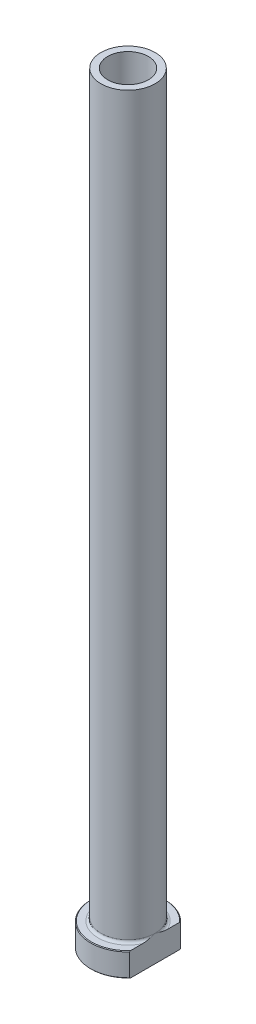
ISO-10303-21;
HEADER;
FILE_DESCRIPTION(('STEP AP214'),'2;1');
FILE_NAME('part.step','',(''),(''),'','','');
FILE_SCHEMA(('AUTOMOTIVE_DESIGN { 1 0 10303 214 1 1 1 1 }'));
ENDSEC;
DATA;
#1=APPLICATION_CONTEXT('core data for automotive mechanical design processes');
#2=APPLICATION_PROTOCOL_DEFINITION('international standard','automotive_design',2000,#1);
#3=PRODUCT_CONTEXT('',#1,'mechanical');
#4=PRODUCT('Part','Part','',(#3));
#5=PRODUCT_RELATED_PRODUCT_CATEGORY('part','',(#4));
#6=PRODUCT_DEFINITION_FORMATION('','',#4);
#7=PRODUCT_DEFINITION_CONTEXT('part definition',#1,'design');
#8=PRODUCT_DEFINITION('design','',#6,#7);
#9=PRODUCT_DEFINITION_SHAPE('','',#8);
#10=(LENGTH_UNIT() NAMED_UNIT(*) SI_UNIT(.MILLI.,.METRE.));
#11=(NAMED_UNIT(*) PLANE_ANGLE_UNIT() SI_UNIT($,.RADIAN.));
#12=(NAMED_UNIT(*) SI_UNIT($,.STERADIAN.) SOLID_ANGLE_UNIT());
#13=UNCERTAINTY_MEASURE_WITH_UNIT(LENGTH_MEASURE(1.E-05),#10,'distance_accuracy_value','');
#14=(GEOMETRIC_REPRESENTATION_CONTEXT(3) GLOBAL_UNCERTAINTY_ASSIGNED_CONTEXT((#13)) GLOBAL_UNIT_ASSIGNED_CONTEXT((#10,
#11,#12)) REPRESENTATION_CONTEXT('',''));
#15=CARTESIAN_POINT('',(0.,0.,0.));
#16=DIRECTION('',(0.,0.,1.));
#17=DIRECTION('',(1.,0.,0.));
#18=AXIS2_PLACEMENT_3D('',#15,#16,#17);
#19=CARTESIAN_POINT('',(0.,92.1876809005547,0.));
#20=DIRECTION('',(0.,1.,0.));
#21=DIRECTION('',(0.,0.,1.));
#22=AXIS2_PLACEMENT_3D('',#19,#20,#21);
#23=CYLINDRICAL_SURFACE('',#22,6.00000000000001);
#24=CARTESIAN_POINT('',(0.,225.,0.));
#25=DIRECTION('',(0.,1.,0.));
#26=DIRECTION('',(0.,0.,1.));
#27=AXIS2_PLACEMENT_3D('',#24,#25,#26);
#28=CIRCLE('',#27,6.00000000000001);
#29=CARTESIAN_POINT('',(0.,225.,6.00000000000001));
#30=VERTEX_POINT('',#29);
#31=EDGE_CURVE('E167',#30,#30,#28,.T.);
#32=ORIENTED_EDGE('',*,*,#31,.T.);
#33=EDGE_LOOP('',(#32));
#34=FACE_BOUND('',#33,.T.);
#35=CARTESIAN_POINT('',(0.,170.,0.));
#36=DIRECTION('',(0.,1.,0.));
#37=DIRECTION('',(0.,0.,1.));
#38=AXIS2_PLACEMENT_3D('',#35,#36,#37);
#39=CIRCLE('',#38,6.00000000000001);
#40=CARTESIAN_POINT('',(0.,170.,6.00000000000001));
#41=VERTEX_POINT('',#40);
#42=EDGE_CURVE('E170',#41,#41,#39,.T.);
#43=ORIENTED_EDGE('',*,*,#42,.F.);
#44=EDGE_LOOP('',(#43));
#45=FACE_BOUND('',#44,.T.);
#46=ADVANCED_FACE('F32',(#34,#45),#23,.F.);
#47=CARTESIAN_POINT('',(-6.00000000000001,225.,0.));
#48=DIRECTION('',(0.,1.,0.));
#49=DIRECTION('',(0.,0.,1.));
#50=AXIS2_PLACEMENT_3D('',#47,#48,#49);
#51=PLANE('',#50);
#52=CARTESIAN_POINT('',(0.,225.,0.));
#53=DIRECTION('',(0.,1.,0.));
#54=DIRECTION('',(0.,0.,1.));
#55=AXIS2_PLACEMENT_3D('',#52,#53,#54);
#56=CIRCLE('',#55,8.00000000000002);
#57=CARTESIAN_POINT('',(0.,225.,8.00000000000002));
#58=VERTEX_POINT('',#57);
#59=EDGE_CURVE('E174',#58,#58,#56,.T.);
#60=ORIENTED_EDGE('',*,*,#59,.T.);
#61=EDGE_LOOP('',(#60));
#62=FACE_BOUND('',#61,.T.);
#63=ORIENTED_EDGE('',*,*,#31,.F.);
#64=EDGE_LOOP('',(#63));
#65=FACE_BOUND('',#64,.T.);
#66=ADVANCED_FACE('F157',(#62,#65),#51,.T.);
#67=CARTESIAN_POINT('',(0.,92.1876809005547,0.));
#68=DIRECTION('',(0.,1.,0.));
#69=DIRECTION('',(0.,0.,1.));
#70=AXIS2_PLACEMENT_3D('',#67,#68,#69);
#71=CYLINDRICAL_SURFACE('',#70,8.);
#72=CARTESIAN_POINT('',(0.,7.8,0.));
#73=DIRECTION('',(0.,1.,0.));
#74=DIRECTION('',(0.,0.,1.));
#75=AXIS2_PLACEMENT_3D('',#72,#73,#74);
#76=CIRCLE('',#75,8.);
#77=CARTESIAN_POINT('',(8.,7.8,0.));
#78=VERTEX_POINT('',#77);
#79=EDGE_CURVE('E180',#78,#78,#76,.T.);
#80=ORIENTED_EDGE('',*,*,#79,.T.);
#81=EDGE_LOOP('',(#80));
#82=FACE_BOUND('',#81,.T.);
#83=ORIENTED_EDGE('',*,*,#59,.F.);
#84=EDGE_LOOP('',(#83));
#85=FACE_BOUND('',#84,.T.);
#86=ADVANCED_FACE('F162',(#82,#85),#71,.T.);
#87=CARTESIAN_POINT('',(-7.99999999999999,7.,0.));
#88=DIRECTION('',(0.,1.,0.));
#89=DIRECTION('',(0.,0.,1.));
#90=AXIS2_PLACEMENT_3D('',#87,#88,#89);
#91=PLANE('',#90);
#92=DIRECTION('',(0.,0.,1.));
#93=VECTOR('',#92,1.);
#94=CARTESIAN_POINT('',(8.,7.,0.));
#95=LINE('',#94,#93);
#96=CARTESIAN_POINT('',(8.,7.,-7.25534285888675));
#97=VERTEX_POINT('',#96);
#98=CARTESIAN_POINT('',(8.,7.,-3.66606055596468));
#99=VERTEX_POINT('',#98);
#100=EDGE_CURVE('E54',#97,#99,#95,.T.);
#101=ORIENTED_EDGE('',*,*,#100,.F.);
#102=CARTESIAN_POINT('',(0.,7.,0.));
#103=DIRECTION('',(0.,1.,0.));
#104=DIRECTION('',(0.,0.,1.));
#105=AXIS2_PLACEMENT_3D('',#102,#103,#104);
#106=CIRCLE('',#105,10.8);
#107=CARTESIAN_POINT('',(8.,7.,7.25534285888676));
#108=VERTEX_POINT('',#107);
#109=EDGE_CURVE('E186',#97,#108,#106,.T.);
#110=ORIENTED_EDGE('',*,*,#109,.T.);
#111=CARTESIAN_POINT('',(8.,7.,3.66606055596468));
#112=VERTEX_POINT('',#111);
#113=EDGE_CURVE('E134',#112,#108,#95,.T.);
#114=ORIENTED_EDGE('',*,*,#113,.F.);
#115=CARTESIAN_POINT('',(0.,7.,0.));
#116=DIRECTION('',(0.,1.,0.));
#117=DIRECTION('',(0.,0.,1.));
#118=AXIS2_PLACEMENT_3D('',#115,#116,#117);
#119=CIRCLE('',#118,8.8);
#120=EDGE_CURVE('E183',#112,#99,#119,.F.);
#121=ORIENTED_EDGE('',*,*,#120,.T.);
#122=EDGE_LOOP('',(#101,#110,#114,#121));
#123=FACE_BOUND('',#122,.T.);
#124=ADVANCED_FACE('F197',(#123),#91,.T.);
#125=CARTESIAN_POINT('',(0.,92.1876809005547,0.));
#126=DIRECTION('',(0.,1.,0.));
#127=DIRECTION('',(0.,0.,1.));
#128=AXIS2_PLACEMENT_3D('',#125,#126,#127);
#129=CYLINDRICAL_SURFACE('',#128,11.);
#130=DIRECTION('',(0.,-1.,0.));
#131=VECTOR('',#130,1.);
#132=CARTESIAN_POINT('',(8.,225.,7.54983443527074));
#133=LINE('',#132,#131);
#134=CARTESIAN_POINT('',(8.,6.79999999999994,7.54983443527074));
#135=VERTEX_POINT('',#134);
#136=CARTESIAN_POINT('',(8.,0.200000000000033,7.54983443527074));
#137=VERTEX_POINT('',#136);
#138=EDGE_CURVE('E82',#135,#137,#133,.T.);
#139=ORIENTED_EDGE('',*,*,#138,.F.);
#140=CARTESIAN_POINT('',(0.,6.79999999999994,0.));
#141=DIRECTION('',(0.,1.,0.));
#142=DIRECTION('',(0.,0.,1.));
#143=AXIS2_PLACEMENT_3D('',#140,#141,#142);
#144=CIRCLE('',#143,11.);
#145=CARTESIAN_POINT('',(8.,6.79999999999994,-7.54983443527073));
#146=VERTEX_POINT('',#145);
#147=EDGE_CURVE('E95',#135,#146,#144,.F.);
#148=ORIENTED_EDGE('',*,*,#147,.T.);
#149=DIRECTION('',(0.,-1.,0.));
#150=VECTOR('',#149,1.);
#151=CARTESIAN_POINT('',(8.,225.,-7.54983443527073));
#152=LINE('',#151,#150);
#153=CARTESIAN_POINT('',(8.,0.200000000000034,-7.54983443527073));
#154=VERTEX_POINT('',#153);
#155=EDGE_CURVE('E192',#146,#154,#152,.T.);
#156=ORIENTED_EDGE('',*,*,#155,.T.);
#157=CARTESIAN_POINT('',(0.,0.200000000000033,0.));
#158=DIRECTION('',(0.,-1.,0.));
#159=DIRECTION('',(0.,0.,-1.));
#160=AXIS2_PLACEMENT_3D('',#157,#158,#159);
#161=CIRCLE('',#160,11.);
#162=EDGE_CURVE('E98',#154,#137,#161,.F.);
#163=ORIENTED_EDGE('',*,*,#162,.T.);
#164=EDGE_LOOP('',(#139,#148,#156,#163));
#165=FACE_BOUND('',#164,.T.);
#166=ADVANCED_FACE('F190',(#165),#129,.T.);
#167=CARTESIAN_POINT('',(-11.,0.,0.));
#168=DIRECTION('',(0.,-1.,0.));
#169=DIRECTION('',(0.,0.,-1.));
#170=AXIS2_PLACEMENT_3D('',#167,#168,#169);
#171=PLANE('',#170);
#172=CARTESIAN_POINT('',(0.,0.,0.));
#173=DIRECTION('',(0.,-1.,0.));
#174=DIRECTION('',(0.,0.,-1.));
#175=AXIS2_PLACEMENT_3D('',#172,#173,#174);
#176=CIRCLE('',#175,6.75000000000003);
#177=CARTESIAN_POINT('',(0.,0.,-6.75000000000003));
#178=VERTEX_POINT('',#177);
#179=EDGE_CURVE('E40',#178,#178,#176,.F.);
#180=ORIENTED_EDGE('',*,*,#179,.T.);
#181=EDGE_LOOP('',(#180));
#182=FACE_BOUND('',#181,.T.);
#183=DIRECTION('',(0.,0.,-1.));
#184=VECTOR('',#183,1.);
#185=CARTESIAN_POINT('',(8.,0.,7.54983443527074));
#186=LINE('',#185,#184);
#187=CARTESIAN_POINT('',(8.,0.,7.25534285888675));
#188=VERTEX_POINT('',#187);
#189=CARTESIAN_POINT('',(8.,0.,-7.25534285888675));
#190=VERTEX_POINT('',#189);
#191=EDGE_CURVE('E47',#188,#190,#186,.T.);
#192=ORIENTED_EDGE('',*,*,#191,.F.);
#193=CARTESIAN_POINT('',(0.,0.,0.));
#194=DIRECTION('',(0.,-1.,0.));
#195=DIRECTION('',(0.,0.,-1.));
#196=AXIS2_PLACEMENT_3D('',#193,#194,#195);
#197=CIRCLE('',#196,10.7999999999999);
#198=EDGE_CURVE('E92',#188,#190,#197,.T.);
#199=ORIENTED_EDGE('',*,*,#198,.T.);
#200=EDGE_LOOP('',(#192,#199));
#201=FACE_BOUND('',#200,.T.);
#202=ADVANCED_FACE('F91',(#182,#201),#171,.T.);
#203=CARTESIAN_POINT('',(0.,92.1876809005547,0.));
#204=DIRECTION('',(0.,1.,0.));
#205=DIRECTION('',(0.,0.,1.));
#206=AXIS2_PLACEMENT_3D('',#203,#204,#205);
#207=CYLINDRICAL_SURFACE('',#206,6.25);
#208=CARTESIAN_POINT('',(0.,0.500000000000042,0.));
#209=DIRECTION('',(0.,-1.,0.));
#210=DIRECTION('',(0.,0.,-1.));
#211=AXIS2_PLACEMENT_3D('',#208,#209,#210);
#212=CIRCLE('',#211,6.25);
#213=CARTESIAN_POINT('',(0.,0.500000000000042,-6.25));
#214=VERTEX_POINT('',#213);
#215=EDGE_CURVE('E11',#214,#214,#212,.T.);
#216=ORIENTED_EDGE('',*,*,#215,.T.);
#217=EDGE_LOOP('',(#216));
#218=FACE_BOUND('',#217,.T.);
#219=CARTESIAN_POINT('',(0.,158.,0.));
#220=DIRECTION('',(0.,1.,0.));
#221=DIRECTION('',(0.,0.,1.));
#222=AXIS2_PLACEMENT_3D('',#219,#220,#221);
#223=CIRCLE('',#222,6.25000000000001);
#224=CARTESIAN_POINT('',(0.,158.,6.25000000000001));
#225=VERTEX_POINT('',#224);
#226=EDGE_CURVE('E172',#225,#225,#223,.T.);
#227=ORIENTED_EDGE('',*,*,#226,.T.);
#228=EDGE_LOOP('',(#227));
#229=FACE_BOUND('',#228,.T.);
#230=ADVANCED_FACE('F215',(#218,#229),#207,.F.);
#231=CARTESIAN_POINT('',(0.,158.,0.));
#232=DIRECTION('',(0.,-1.,0.));
#233=DIRECTION('',(0.,0.,-1.));
#234=AXIS2_PLACEMENT_3D('',#231,#232,#233);
#235=CONICAL_SURFACE('',#234,6.25000000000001,0.0208303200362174);
#236=ORIENTED_EDGE('',*,*,#42,.T.);
#237=EDGE_LOOP('',(#236));
#238=FACE_BOUND('',#237,.T.);
#239=ORIENTED_EDGE('',*,*,#226,.F.);
#240=EDGE_LOOP('',(#239));
#241=FACE_BOUND('',#240,.T.);
#242=ADVANCED_FACE('F111',(#238,#241),#235,.F.);
#243=CARTESIAN_POINT('',(0.,7.8,0.));
#244=DIRECTION('',(0.,1.,0.));
#245=DIRECTION('',(0.,0.,1.));
#246=AXIS2_PLACEMENT_3D('',#243,#244,#245);
#247=TOROIDAL_SURFACE('',#246,8.8,0.8);
#248=ORIENTED_EDGE('',*,*,#120,.F.);
#249=CARTESIAN_POINT('',(8.,7.8,0.));
#250=CARTESIAN_POINT('',(8.,7.80000101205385,-1.09663887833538E-10));
#251=CARTESIAN_POINT('',(8.,7.80000202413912,2.93324122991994E-07));
#252=CARTESIAN_POINT('',(8.,7.80000394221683,1.16283100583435E-06));
#253=CARTESIAN_POINT('',(8.,7.80000483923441,1.75365147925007E-06));
#254=CARTESIAN_POINT('',(8.,7.80000665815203,3.16446795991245E-06));
#255=CARTESIAN_POINT('',(8.,7.80000756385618,4.00549183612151E-06));
#256=CARTESIAN_POINT('',(8.,7.80000923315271,5.78347948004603E-06));
#257=CARTESIAN_POINT('',(8.,7.8000099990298,6.71842053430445E-06));
#258=CARTESIAN_POINT('',(8.,7.80001270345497,1.02037220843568E-05));
#259=CARTESIAN_POINT('',(8.,7.80001449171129,1.28740408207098E-05));
#260=CARTESIAN_POINT('',(8.,7.80001755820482,1.82727392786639E-05));
#261=CARTESIAN_POINT('',(8.,7.8000188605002,2.09881564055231E-05));
#262=CARTESIAN_POINT('',(8.,7.80002405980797,3.2064781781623E-05));
#263=CARTESIAN_POINT('',(8.,7.8000277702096,4.05225605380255E-05));
#264=CARTESIAN_POINT('',(8.,7.80003348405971,5.68037726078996E-05));
#265=CARTESIAN_POINT('',(8.,7.80003564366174,6.45728891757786E-05));
#266=CARTESIAN_POINT('',(8.,7.8000509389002,0.000121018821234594));
#267=CARTESIAN_POINT('',(8.,7.80006211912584,0.000170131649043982));
#268=CARTESIAN_POINT('',(8.,7.80011099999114,0.000362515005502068));
#269=CARTESIAN_POINT('',(8.,7.80015802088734,0.000503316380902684));
#270=CARTESIAN_POINT('',(8.,7.80033939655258,0.00105711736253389));
#271=CARTESIAN_POINT('',(8.,7.80046737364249,0.0014716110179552));
#272=CARTESIAN_POINT('',(8.,7.80097644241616,0.00310648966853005));
#273=CARTESIAN_POINT('',(8.,7.80136531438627,0.00432501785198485));
#274=CARTESIAN_POINT('',(8.,7.80297358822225,0.0093795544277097));
#275=CARTESIAN_POINT('',(8.,7.80418342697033,0.0132178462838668));
#276=CARTESIAN_POINT('',(7.99999999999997,7.82754122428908,0.0873020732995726));
#277=CARTESIAN_POINT('',(7.99999999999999,7.84979021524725,0.157524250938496));
#278=CARTESIAN_POINT('',(8.00000000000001,7.89322681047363,0.295235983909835));
#279=CARTESIAN_POINT('',(8.,7.91442151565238,0.362723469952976));
#280=CARTESIAN_POINT('',(8.,7.95923432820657,0.506178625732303));
#281=CARTESIAN_POINT('',(8.,7.98282525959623,0.58215493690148));
#282=CARTESIAN_POINT('',(8.,8.02983069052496,0.735069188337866));
#283=CARTESIAN_POINT('',(8.,8.05324046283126,0.812008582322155));
#284=CARTESIAN_POINT('',(8.,8.09303795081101,0.944645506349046));
#285=CARTESIAN_POINT('',(8.,8.10956807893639,1.00030022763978));
#286=CARTESIAN_POINT('',(8.,8.14221289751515,1.11157683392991));
#287=CARTESIAN_POINT('',(8.,8.15832854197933,1.16719843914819));
#288=CARTESIAN_POINT('',(8.,8.20527739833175,1.33164052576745));
#289=CARTESIAN_POINT('',(8.,8.23549814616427,1.44063711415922));
#290=CARTESIAN_POINT('',(8.,8.29826335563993,1.67606835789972));
#291=CARTESIAN_POINT('',(8.,8.33044741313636,1.80259995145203));
#292=CARTESIAN_POINT('',(8.,8.39126396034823,2.05750030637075));
#293=CARTESIAN_POINT('',(8.,8.41986879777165,2.18587573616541));
#294=CARTESIAN_POINT('',(8.,8.47414203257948,2.45321874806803));
#295=CARTESIAN_POINT('',(8.,8.49943375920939,2.59226394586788));
#296=CARTESIAN_POINT('',(8.,8.54278750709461,2.87150561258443));
#297=CARTESIAN_POINT('',(8.,8.56085024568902,3.01170196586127));
#298=CARTESIAN_POINT('',(8.,8.58291287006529,3.24319459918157));
#299=CARTESIAN_POINT('',(8.,8.58962750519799,3.33423069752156));
#300=CARTESIAN_POINT('',(8.,8.59844042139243,3.51651109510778));
#301=CARTESIAN_POINT('',(8.,8.60054027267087,3.60775531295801));
#302=CARTESIAN_POINT('',(8.,8.59923478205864,3.78855451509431));
#303=CARTESIAN_POINT('',(8.,8.59592927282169,3.87810991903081));
#304=CARTESIAN_POINT('',(8.,8.58288784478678,4.05671727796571));
#305=CARTESIAN_POINT('',(8.,8.5731571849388,4.14576958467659));
#306=CARTESIAN_POINT('',(8.,8.54786053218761,4.30910044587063));
#307=CARTESIAN_POINT('',(8.,8.53341905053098,4.38354919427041));
#308=CARTESIAN_POINT('',(8.,8.4974754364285,4.53120906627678));
#309=CARTESIAN_POINT('',(8.,8.47593618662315,4.60441150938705));
#310=CARTESIAN_POINT('',(8.,8.42376924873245,4.74853436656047));
#311=CARTESIAN_POINT('',(8.,8.39303920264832,4.8194185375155));
#312=CARTESIAN_POINT('',(8.,8.32008168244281,4.95490582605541));
#313=CARTESIAN_POINT('',(8.,8.27792970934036,5.01954653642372));
#314=CARTESIAN_POINT('',(8.,8.20692535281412,5.10354772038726));
#315=CARTESIAN_POINT('',(8.,8.1839783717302,5.12788591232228));
#316=CARTESIAN_POINT('',(8.,8.13503511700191,5.17336988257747));
#317=CARTESIAN_POINT('',(8.,8.10903727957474,5.19451401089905));
#318=CARTESIAN_POINT('',(8.,8.05362521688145,5.23266411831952));
#319=CARTESIAN_POINT('',(8.,8.02417247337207,5.2496152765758));
#320=CARTESIAN_POINT('',(8.,7.96255238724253,5.27751973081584));
#321=CARTESIAN_POINT('',(8.,7.93039220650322,5.28848831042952));
#322=CARTESIAN_POINT('',(8.,7.87282733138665,5.30129051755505));
#323=CARTESIAN_POINT('',(8.,7.84777777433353,5.30473535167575));
#324=CARTESIAN_POINT('',(8.,7.7974579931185,5.30730687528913));
#325=CARTESIAN_POINT('',(8.,7.77218785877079,5.30643524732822));
#326=CARTESIAN_POINT('',(8.,7.72220872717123,5.30045124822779));
#327=CARTESIAN_POINT('',(8.,7.69749884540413,5.29534612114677));
#328=CARTESIAN_POINT('',(8.,7.64919855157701,5.28130622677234));
#329=CARTESIAN_POINT('',(8.,7.62560888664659,5.27236894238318));
#330=CARTESIAN_POINT('',(8.,7.57186978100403,5.24749103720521));
#331=CARTESIAN_POINT('',(8.,7.54235117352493,5.23019143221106));
#332=CARTESIAN_POINT('',(8.,7.48647501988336,5.1910787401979));
#333=CARTESIAN_POINT('',(8.,7.46012476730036,5.16925554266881));
#334=CARTESIAN_POINT('',(8.,7.39758131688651,5.11005232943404));
#335=CARTESIAN_POINT('',(8.,7.36345256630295,5.07050732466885));
#336=CARTESIAN_POINT('',(8.,7.30158414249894,4.9868053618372));
#337=CARTESIAN_POINT('',(8.,7.27385227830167,4.9426428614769));
#338=CARTESIAN_POINT('',(8.,7.22655631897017,4.85651446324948));
#339=CARTESIAN_POINT('',(8.,7.20642608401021,4.81485346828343));
#340=CARTESIAN_POINT('',(8.,7.16979237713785,4.72995016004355));
#341=CARTESIAN_POINT('',(8.,7.15329194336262,4.6867065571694));
#342=CARTESIAN_POINT('',(8.,7.10824755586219,4.55471342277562));
#343=CARTESIAN_POINT('',(8.,7.08448205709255,4.46433285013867));
#344=CARTESIAN_POINT('',(8.,7.04606817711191,4.27884520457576));
#345=CARTESIAN_POINT('',(8.,7.03172934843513,4.18367881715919));
#346=CARTESIAN_POINT('',(8.,7.01115182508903,3.99231790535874));
#347=CARTESIAN_POINT('',(8.,7.004929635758,3.89612168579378));
#348=CARTESIAN_POINT('',(8.,6.99917472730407,3.70683203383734));
#349=CARTESIAN_POINT('',(8.,6.99942213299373,3.61374410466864));
#350=CARTESIAN_POINT('',(8.,7.00500334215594,3.42814181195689));
#351=CARTESIAN_POINT('',(8.,7.01031504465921,3.33562671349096));
#352=CARTESIAN_POINT('',(8.,7.027292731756,3.12465235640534));
#353=CARTESIAN_POINT('',(8.,7.04033732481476,3.00630616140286));
#354=CARTESIAN_POINT('',(8.,7.0720601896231,2.77043320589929));
#355=CARTESIAN_POINT('',(8.,7.09073668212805,2.65290619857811));
#356=CARTESIAN_POINT('',(8.,7.13314336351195,2.41598317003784));
#357=CARTESIAN_POINT('',(8.,7.15698005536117,2.29660645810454));
#358=CARTESIAN_POINT('',(8.,7.20856500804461,2.05839418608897));
#359=CARTESIAN_POINT('',(8.,7.23632304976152,1.9395607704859));
#360=CARTESIAN_POINT('',(8.,7.30538420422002,1.66026758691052));
#361=CARTESIAN_POINT('',(8.,7.34797978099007,1.50012949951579));
#362=CARTESIAN_POINT('',(8.,7.43661699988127,1.18271330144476));
#363=CARTESIAN_POINT('',(8.,7.48261587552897,1.02542306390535));
#364=CARTESIAN_POINT('',(8.,7.55073856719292,0.798945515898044));
#365=CARTESIAN_POINT('',(8.,7.57189590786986,0.729464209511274));
#366=CARTESIAN_POINT('',(8.,7.61466169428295,0.590318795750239));
#367=CARTESIAN_POINT('',(8.,7.63627166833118,0.520655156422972));
#368=CARTESIAN_POINT('',(8.,7.68075896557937,0.37807296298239));
#369=CARTESIAN_POINT('',(8.00000000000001,7.70364749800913,0.305157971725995));
#370=CARTESIAN_POINT('',(7.99999999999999,7.74926260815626,0.160522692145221));
#371=CARTESIAN_POINT('',(7.99999999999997,7.77198614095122,0.0888015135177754));
#372=CARTESIAN_POINT('',(8.,7.79581756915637,0.0132146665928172));
#373=CARTESIAN_POINT('',(8.,7.79702841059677,0.00937319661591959));
#374=CARTESIAN_POINT('',(8.,7.79863692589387,0.00431792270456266));
#375=CARTESIAN_POINT('',(8.,7.79902501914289,0.0031018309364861));
#376=CARTESIAN_POINT('',(8.,7.79953313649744,0.00147000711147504));
#377=CARTESIAN_POINT('',(8.,7.79966092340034,0.00105612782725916));
#378=CARTESIAN_POINT('',(8.,7.79984206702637,0.000503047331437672));
#379=CARTESIAN_POINT('',(8.,7.79988905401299,0.00036235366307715));
#380=CARTESIAN_POINT('',(8.,7.79993790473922,0.000170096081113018));
#381=CARTESIAN_POINT('',(8.,7.79994908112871,0.000120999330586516));
#382=CARTESIAN_POINT('',(8.,7.79996436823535,6.45695843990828E-05));
#383=CARTESIAN_POINT('',(8.,7.79996652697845,5.68014515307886E-05));
#384=CARTESIAN_POINT('',(8.,7.79997223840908,4.05221734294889E-05));
#385=CARTESIAN_POINT('',(8.,7.79997594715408,3.20652948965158E-05));
#386=CARTESIAN_POINT('',(8.,7.79998114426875,2.09895718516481E-05));
#387=CARTESIAN_POINT('',(8.,7.7999824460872,1.82742281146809E-05));
#388=CARTESIAN_POINT('',(8.,7.79998551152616,1.2875590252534E-05));
#389=CARTESIAN_POINT('',(8.,7.79998729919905,1.02052512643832E-05));
#390=CARTESIAN_POINT('',(8.,7.79999000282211,6.71981951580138E-06));
#391=CARTESIAN_POINT('',(8.,7.79999076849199,5.78481878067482E-06));
#392=CARTESIAN_POINT('',(8.,7.79999243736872,4.00667444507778E-06));
#393=CARTESIAN_POINT('',(8.,7.79999334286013,3.16555273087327E-06));
#394=CARTESIAN_POINT('',(8.,7.79999516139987,1.75450266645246E-06));
#395=CARTESIAN_POINT('',(8.,7.7999960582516,1.16355341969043E-06));
#396=CARTESIAN_POINT('',(8.,7.79999797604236,2.93728367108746E-07));
#397=CARTESIAN_POINT('',(8.,7.79999898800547,1.09661137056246E-10));
#398=CARTESIAN_POINT('',(8.,7.8,0.));
#399=B_SPLINE_CURVE_WITH_KNOTS('',3,(#249,#250,#251,#252,#253,#254,#255,#256,#257,#258,#259,
#260,#261,#262,#263,#264,#265,#266,#267,#268,#269,#270,#271,#272,#273,#274,#275,#276,#277,#278,
#279,#280,#281,#282,#283,#284,#285,#286,#287,#288,#289,#290,#291,#292,#293,#294,#295,#296,#297,
#298,#299,#300,#301,#302,#303,#304,#305,#306,#307,#308,#309,#310,#311,#312,#313,#314,#315,#316,
#317,#318,#319,#320,#321,#322,#323,#324,#325,#326,#327,#328,#329,#330,#331,#332,#333,#334,#335,
#336,#337,#338,#339,#340,#341,#342,#343,#344,#345,#346,#347,#348,#349,#350,#351,#352,#353,#354,
#355,#356,#357,#358,#359,#360,#361,#362,#363,#364,#365,#366,#367,#368,#369,#370,#371,#372,#373,
#374,#375,#376,#377,#378,#379,#380,#381,#382,#383,#384,#385,#386,#387,#388,#389,#390,#391,#392,
#393,#394,#395,#396,#397,#398),.UNSPECIFIED.,.T.,.F.,(4,2,2,2,2,2,2,2,2,2,2,2,2,2,2,2,2,2,2,2,2,
2,2,2,2,2,2,2,2,2,2,2,2,2,2,2,2,2,2,2,2,2,2,2,2,2,2,2,2,2,2,2,2,2,2,2,2,2,2,2,2,2,2,2,2,2,2,2,2,
2,2,2,2,2,4),(0.,3.04287455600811E-06,6.25419973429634E-06,9.94386247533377E-06,
1.35664308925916E-05,2.31665004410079E-05,3.21939784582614E-05,5.98353369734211E-05,
8.3994464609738E-05,0.000235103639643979,0.000679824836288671,0.00198183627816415,
0.00581831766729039,0.0178924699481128,0.238870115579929,0.451084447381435,0.689746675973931,
0.931010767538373,1.10518257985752,1.27890913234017,1.6182180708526,2.00985537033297,
2.40435266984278,2.82819297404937,3.25199120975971,3.5257483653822,3.79941235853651,
4.06807884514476,4.33652570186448,4.56378083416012,4.7922437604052,5.02335234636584,
5.25296903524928,5.35309534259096,5.45327319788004,5.55469877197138,5.65586400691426,
5.73137360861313,5.8068537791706,5.88220505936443,5.95760590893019,6.05967508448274,
6.16197489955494,6.31780492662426,6.47382418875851,6.61243130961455,6.75115400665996,
7.03070266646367,7.31902502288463,7.60793277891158,7.88703491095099,8.1649245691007,
8.52193605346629,8.87883486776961,9.24395493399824,9.61000233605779,10.107042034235,
10.5986476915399,10.8165407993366,11.0353545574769,11.2646261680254,11.4903206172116,
11.5024047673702,11.5062335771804,11.5075336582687,11.5079780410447,11.5081291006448,
11.5081532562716,11.5081808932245,11.5081899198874,11.5081995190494,11.5082031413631,
11.5082068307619,11.5082100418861,11.5082130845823),.UNSPECIFIED.);
#400=EDGE_CURVE('E126',#112,#78,#399,.T.);
#401=ORIENTED_EDGE('',*,*,#400,.T.);
#402=ORIENTED_EDGE('',*,*,#79,.F.);
#403=CARTESIAN_POINT('',(8.,7.8,0.));
#404=CARTESIAN_POINT('',(8.,7.79999898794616,1.09667807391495E-10));
#405=CARTESIAN_POINT('',(8.,7.79999797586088,-2.93324119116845E-07));
#406=CARTESIAN_POINT('',(8.,7.79999605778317,-1.16283100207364E-06));
#407=CARTESIAN_POINT('',(8.,7.79999516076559,-1.7536514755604E-06));
#408=CARTESIAN_POINT('',(8.,7.79999334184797,-3.16446795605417E-06));
#409=CARTESIAN_POINT('',(8.,7.79999243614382,-4.00549183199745E-06));
#410=CARTESIAN_POINT('',(8.,7.79999076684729,-5.78347947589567E-06));
#411=CARTESIAN_POINT('',(8.,7.7999900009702,-6.71842053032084E-06));
#412=CARTESIAN_POINT('',(8.,7.79998729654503,-1.02037220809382E-05));
#413=CARTESIAN_POINT('',(8.,7.79998550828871,-1.28740408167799E-05));
#414=CARTESIAN_POINT('',(8.,7.79998244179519,-1.82727392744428E-05));
#415=CARTESIAN_POINT('',(8.,7.7999811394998,-2.09881564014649E-05));
#416=CARTESIAN_POINT('',(8.,7.79997594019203,-3.20647817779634E-05));
#417=CARTESIAN_POINT('',(8.,7.7999722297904,-4.05225605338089E-05));
#418=CARTESIAN_POINT('',(8.,7.79996651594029,-5.68037726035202E-05));
#419=CARTESIAN_POINT('',(8.,7.79996435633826,-6.45728891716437E-05));
#420=CARTESIAN_POINT('',(8.,7.7999490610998,-0.00012101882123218));
#421=CARTESIAN_POINT('',(8.,7.79993788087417,-0.00017013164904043));
#422=CARTESIAN_POINT('',(8.,7.79988900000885,-0.000362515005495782));
#423=CARTESIAN_POINT('',(8.,7.79984197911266,-0.000503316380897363));
#424=CARTESIAN_POINT('',(8.,7.79966060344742,-0.00105711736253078));
#425=CARTESIAN_POINT('',(8.,7.79953262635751,-0.0014716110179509));
#426=CARTESIAN_POINT('',(8.,7.79902355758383,-0.0031064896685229));
#427=CARTESIAN_POINT('',(8.,7.79863468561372,-0.004325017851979));
#428=CARTESIAN_POINT('',(8.,7.79702641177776,-0.00937955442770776));
#429=CARTESIAN_POINT('',(8.,7.79581657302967,-0.0132178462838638));
#430=CARTESIAN_POINT('',(7.99999999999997,7.77245877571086,-0.0873020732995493));
#431=CARTESIAN_POINT('',(7.99999999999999,7.75020978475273,-0.157524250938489));
#432=CARTESIAN_POINT('',(8.00000000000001,7.70677318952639,-0.295235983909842));
#433=CARTESIAN_POINT('',(8.,7.68557848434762,-0.362723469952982));
#434=CARTESIAN_POINT('',(8.,7.64076567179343,-0.506178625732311));
#435=CARTESIAN_POINT('',(8.,7.61717474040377,-0.582154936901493));
#436=CARTESIAN_POINT('',(8.,7.57016930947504,-0.735069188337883));
#437=CARTESIAN_POINT('',(8.,7.54675953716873,-0.812008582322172));
#438=CARTESIAN_POINT('',(8.,7.50696204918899,-0.944645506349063));
#439=CARTESIAN_POINT('',(8.,7.4904319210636,-1.00030022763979));
#440=CARTESIAN_POINT('',(8.,7.45778710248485,-1.11157683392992));
#441=CARTESIAN_POINT('',(8.,7.44167145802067,-1.1671984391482));
#442=CARTESIAN_POINT('',(8.,7.39472260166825,-1.33164052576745));
#443=CARTESIAN_POINT('',(8.,7.36450185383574,-1.44063711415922));
#444=CARTESIAN_POINT('',(8.,7.30173664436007,-1.67606835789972));
#445=CARTESIAN_POINT('',(8.,7.26955258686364,-1.80259995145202));
#446=CARTESIAN_POINT('',(8.,7.20873603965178,-2.05750030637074));
#447=CARTESIAN_POINT('',(8.,7.18013120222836,-2.1858757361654));
#448=CARTESIAN_POINT('',(8.,7.12585796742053,-2.45321874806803));
#449=CARTESIAN_POINT('',(8.,7.10056624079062,-2.59226394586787));
#450=CARTESIAN_POINT('',(8.,7.0572124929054,-2.87150561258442));
#451=CARTESIAN_POINT('',(8.,7.03914975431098,-3.01170196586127));
#452=CARTESIAN_POINT('',(8.,7.01708712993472,-3.24319459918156));
#453=CARTESIAN_POINT('',(8.,7.01037249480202,-3.33423069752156));
#454=CARTESIAN_POINT('',(8.,7.00155957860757,-3.51651109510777));
#455=CARTESIAN_POINT('',(8.,6.99945972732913,-3.607755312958));
#456=CARTESIAN_POINT('',(8.,7.00076521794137,-3.7885545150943));
#457=CARTESIAN_POINT('',(8.,7.00407072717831,-3.8781099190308));
#458=CARTESIAN_POINT('',(8.,7.01711215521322,-4.0567172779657));
#459=CARTESIAN_POINT('',(8.,7.02684281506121,-4.14576958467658));
#460=CARTESIAN_POINT('',(8.,7.05213946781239,-4.30910044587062));
#461=CARTESIAN_POINT('',(8.,7.06658094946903,-4.3835491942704));
#462=CARTESIAN_POINT('',(8.,7.1025245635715,-4.53120906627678));
#463=CARTESIAN_POINT('',(8.,7.12406381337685,-4.60441150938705));
#464=CARTESIAN_POINT('',(8.,7.17623075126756,-4.74853436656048));
#465=CARTESIAN_POINT('',(8.,7.20696079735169,-4.8194185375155));
#466=CARTESIAN_POINT('',(8.,7.2799183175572,-4.95490582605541));
#467=CARTESIAN_POINT('',(8.,7.32207029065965,-5.01954653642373));
#468=CARTESIAN_POINT('',(8.,7.39307464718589,-5.10354772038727));
#469=CARTESIAN_POINT('',(8.,7.41602162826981,-5.12788591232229));
#470=CARTESIAN_POINT('',(8.,7.46496488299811,-5.17336988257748));
#471=CARTESIAN_POINT('',(8.,7.49096272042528,-5.19451401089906));
#472=CARTESIAN_POINT('',(8.,7.54637478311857,-5.23266411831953));
#473=CARTESIAN_POINT('',(8.,7.57582752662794,-5.24961527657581));
#474=CARTESIAN_POINT('',(8.,7.63744761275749,-5.27751973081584));
#475=CARTESIAN_POINT('',(8.,7.6696077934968,-5.28848831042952));
#476=CARTESIAN_POINT('',(8.,7.72717266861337,-5.30129051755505));
#477=CARTESIAN_POINT('',(8.,7.75222222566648,-5.30473535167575));
#478=CARTESIAN_POINT('',(8.,7.80254200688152,-5.30730687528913));
#479=CARTESIAN_POINT('',(8.,7.82781214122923,-5.30643524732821));
#480=CARTESIAN_POINT('',(8.,7.87779127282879,-5.30045124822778));
#481=CARTESIAN_POINT('',(8.,7.90250115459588,-5.29534612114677));
#482=CARTESIAN_POINT('',(8.,7.950801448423,-5.28130622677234));
#483=CARTESIAN_POINT('',(8.,7.97439111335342,-5.27236894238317));
#484=CARTESIAN_POINT('',(8.,8.02813021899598,-5.2474910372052));
#485=CARTESIAN_POINT('',(8.,8.05764882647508,-5.23019143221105));
#486=CARTESIAN_POINT('',(8.,8.11352498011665,-5.19107874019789));
#487=CARTESIAN_POINT('',(8.,8.13987523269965,-5.1692555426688));
#488=CARTESIAN_POINT('',(8.,8.20241868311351,-5.11005232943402));
#489=CARTESIAN_POINT('',(8.,8.23654743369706,-5.07050732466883));
#490=CARTESIAN_POINT('',(8.,8.29841585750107,-4.98680536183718));
#491=CARTESIAN_POINT('',(8.,8.32614772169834,-4.94264286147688));
#492=CARTESIAN_POINT('',(8.,8.37344368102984,-4.85651446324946));
#493=CARTESIAN_POINT('',(8.,8.3935739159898,-4.8148534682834));
#494=CARTESIAN_POINT('',(8.,8.43020762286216,-4.72995016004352));
#495=CARTESIAN_POINT('',(8.,8.44670805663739,-4.68670655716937));
#496=CARTESIAN_POINT('',(8.,8.49175244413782,-4.55471342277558));
#497=CARTESIAN_POINT('',(8.,8.51551794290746,-4.46433285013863));
#498=CARTESIAN_POINT('',(8.,8.5539318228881,-4.27884520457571));
#499=CARTESIAN_POINT('',(8.,8.56827065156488,-4.18367881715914));
#500=CARTESIAN_POINT('',(8.,8.58884817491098,-3.99231790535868));
#501=CARTESIAN_POINT('',(8.,8.59507036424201,-3.89612168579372));
#502=CARTESIAN_POINT('',(8.,8.60082527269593,-3.70683203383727));
#503=CARTESIAN_POINT('',(8.,8.60057786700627,-3.61374410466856));
#504=CARTESIAN_POINT('',(8.,8.59499665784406,-3.42814181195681));
#505=CARTESIAN_POINT('',(8.,8.58968495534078,-3.33562671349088));
#506=CARTESIAN_POINT('',(8.,8.57270726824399,-3.12465235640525));
#507=CARTESIAN_POINT('',(8.,8.55966267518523,-3.00630616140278));
#508=CARTESIAN_POINT('',(8.,8.52793981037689,-2.77043320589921));
#509=CARTESIAN_POINT('',(8.,8.50926331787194,-2.65290619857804));
#510=CARTESIAN_POINT('',(8.,8.46685663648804,-2.41598317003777));
#511=CARTESIAN_POINT('',(8.,8.44301994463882,-2.29660645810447));
#512=CARTESIAN_POINT('',(8.,8.39143499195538,-2.05839418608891));
#513=CARTESIAN_POINT('',(8.,8.36367695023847,-1.93956077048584));
#514=CARTESIAN_POINT('',(8.,8.29461579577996,-1.66026758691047));
#515=CARTESIAN_POINT('',(8.,8.25202021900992,-1.50012949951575));
#516=CARTESIAN_POINT('',(8.,8.16338300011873,-1.18271330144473));
#517=CARTESIAN_POINT('',(8.,8.11738412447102,-1.02542306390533));
#518=CARTESIAN_POINT('',(8.,8.04926143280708,-0.79894551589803));
#519=CARTESIAN_POINT('',(8.,8.02810409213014,-0.72946420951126));
#520=CARTESIAN_POINT('',(8.,7.98533830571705,-0.590318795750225));
#521=CARTESIAN_POINT('',(8.,7.96372833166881,-0.520655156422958));
#522=CARTESIAN_POINT('',(8.,7.91924103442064,-0.378072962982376));
#523=CARTESIAN_POINT('',(8.00000000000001,7.89635250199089,-0.305157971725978));
#524=CARTESIAN_POINT('',(7.99999999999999,7.85073739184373,-0.16052269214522));
#525=CARTESIAN_POINT('',(7.99999999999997,7.82801385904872,-0.088801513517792));
#526=CARTESIAN_POINT('',(8.,7.80418243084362,-0.0132146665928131));
#527=CARTESIAN_POINT('',(8.,7.80297158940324,-0.00937319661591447));
#528=CARTESIAN_POINT('',(8.,7.80136307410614,-0.00431792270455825));
#529=CARTESIAN_POINT('',(8.,7.80097498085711,-0.00310183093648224));
#530=CARTESIAN_POINT('',(8.,7.80046686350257,-0.00147000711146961));
#531=CARTESIAN_POINT('',(8.,7.80033907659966,-0.00105612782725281));
#532=CARTESIAN_POINT('',(8.,7.80015793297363,-0.000503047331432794));
#533=CARTESIAN_POINT('',(8.,7.80011094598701,-0.00036235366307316));
#534=CARTESIAN_POINT('',(8.,7.80006209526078,-0.000170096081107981));
#535=CARTESIAN_POINT('',(8.,7.80005091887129,-0.000120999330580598));
#536=CARTESIAN_POINT('',(8.,7.80003563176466,-6.45695843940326E-05));
#537=CARTESIAN_POINT('',(8.,7.80003347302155,-5.68014515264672E-05));
#538=CARTESIAN_POINT('',(8.,7.80002776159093,-4.05221734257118E-05));
#539=CARTESIAN_POINT('',(8.,7.80002405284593,-3.20652948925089E-05));
#540=CARTESIAN_POINT('',(8.,7.80001885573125,-2.09895718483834E-05));
#541=CARTESIAN_POINT('',(8.,7.80001755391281,-1.8274228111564E-05));
#542=CARTESIAN_POINT('',(8.,7.80001448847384,-1.28755902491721E-05));
#543=CARTESIAN_POINT('',(8.,7.80001270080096,-1.02052512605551E-05));
#544=CARTESIAN_POINT('',(8.,7.80000999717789,-6.71981951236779E-06));
#545=CARTESIAN_POINT('',(8.,7.80000923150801,-5.78481877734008E-06));
#546=CARTESIAN_POINT('',(8.,7.80000756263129,-4.00667444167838E-06));
#547=CARTESIAN_POINT('',(8.,7.80000665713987,-3.16555272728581E-06));
#548=CARTESIAN_POINT('',(8.,7.80000483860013,-1.75450266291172E-06));
#549=CARTESIAN_POINT('',(8.,7.8000039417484,-1.16355341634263E-06));
#550=CARTESIAN_POINT('',(8.,7.80000202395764,-2.93728363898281E-07));
#551=CARTESIAN_POINT('',(8.,7.80000101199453,-1.09657703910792E-10));
#552=CARTESIAN_POINT('',(8.,7.8,0.));
#553=B_SPLINE_CURVE_WITH_KNOTS('',3,(#403,#404,#405,#406,#407,#408,#409,#410,#411,#412,#413,
#414,#415,#416,#417,#418,#419,#420,#421,#422,#423,#424,#425,#426,#427,#428,#429,#430,#431,#432,
#433,#434,#435,#436,#437,#438,#439,#440,#441,#442,#443,#444,#445,#446,#447,#448,#449,#450,#451,
#452,#453,#454,#455,#456,#457,#458,#459,#460,#461,#462,#463,#464,#465,#466,#467,#468,#469,#470,
#471,#472,#473,#474,#475,#476,#477,#478,#479,#480,#481,#482,#483,#484,#485,#486,#487,#488,#489,
#490,#491,#492,#493,#494,#495,#496,#497,#498,#499,#500,#501,#502,#503,#504,#505,#506,#507,#508,
#509,#510,#511,#512,#513,#514,#515,#516,#517,#518,#519,#520,#521,#522,#523,#524,#525,#526,#527,
#528,#529,#530,#531,#532,#533,#534,#535,#536,#537,#538,#539,#540,#541,#542,#543,#544,#545,#546,
#547,#548,#549,#550,#551,#552),.UNSPECIFIED.,.T.,.F.,(4,2,2,2,2,2,2,2,2,2,2,2,2,2,2,2,2,2,2,2,2,
2,2,2,2,2,2,2,2,2,2,2,2,2,2,2,2,2,2,2,2,2,2,2,2,2,2,2,2,2,2,2,2,2,2,2,2,2,2,2,2,2,2,2,2,2,2,2,2,
2,2,2,2,2,4),(0.,3.04287455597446E-06,6.25419973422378E-06,9.94386247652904E-06,
1.35664308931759E-05,2.31665004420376E-05,3.21939784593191E-05,5.98353369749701E-05,
8.39944646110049E-05,0.000235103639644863,0.00067982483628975,0.00198183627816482,
0.00581831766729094,0.0178924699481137,0.238870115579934,0.451084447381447,0.689746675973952,
0.931010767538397,1.10518257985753,1.27890913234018,1.6182180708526,2.00985537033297,
2.40435266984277,2.82819297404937,3.25199120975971,3.5257483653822,3.79941235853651,
4.06807884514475,4.33652570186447,4.56378083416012,4.7922437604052,5.02335234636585,
5.2529690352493,5.35309534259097,5.45327319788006,5.55469877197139,5.65586400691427,
5.73137360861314,5.80685377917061,5.88220505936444,5.9576059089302,6.05967508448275,
6.16197489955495,6.31780492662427,6.47382418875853,6.61243130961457,6.75115400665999,
7.03070266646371,7.31902502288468,7.60793277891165,7.88703491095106,8.16492456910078,
8.52193605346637,8.87883486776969,9.2439549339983,9.61000233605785,10.1070420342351,
10.5986476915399,10.8165407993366,11.0353545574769,11.2646261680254,11.4903206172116,
11.5024047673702,11.5062335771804,11.5075336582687,11.5079780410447,11.5081291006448,
11.5081532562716,11.5081808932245,11.5081899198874,11.5081995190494,11.5082031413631,
11.5082068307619,11.5082100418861,11.5082130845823),.UNSPECIFIED.);
#554=EDGE_CURVE('E135',#78,#99,#553,.T.);
#555=ORIENTED_EDGE('',*,*,#554,.T.);
#556=EDGE_LOOP('',(#248,#401,#402,#555));
#557=FACE_BOUND('',#556,.T.);
#558=ADVANCED_FACE('F141',(#557),#247,.F.);
#559=CARTESIAN_POINT('',(0.,7.00000000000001,0.));
#560=DIRECTION('',(0.,-1.,0.));
#561=DIRECTION('',(0.,0.,-1.));
#562=AXIS2_PLACEMENT_3D('',#559,#560,#561);
#563=CONICAL_SURFACE('',#562,10.7999999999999,0.785398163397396);
#564=CARTESIAN_POINT('',(8.,-0.636730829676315,-16.6106304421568));
#565=CARTESIAN_POINT('',(8.,-0.418611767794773,-16.3685283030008));
#566=CARTESIAN_POINT('',(8.,-0.200984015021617,-16.1259843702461));
#567=CARTESIAN_POINT('',(8.,0.233148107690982,-15.6398927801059));
#568=CARTESIAN_POINT('',(8.,0.449652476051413,-15.3963451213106));
#569=CARTESIAN_POINT('',(8.,1.09739989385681,-14.6638687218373));
#570=CARTESIAN_POINT('',(8.,1.52674426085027,-14.1732538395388));
#571=CARTESIAN_POINT('',(8.,2.16792810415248,-13.4304656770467));
#572=CARTESIAN_POINT('',(8.,2.38226067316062,-13.1804430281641));
#573=CARTESIAN_POINT('',(8.,2.80892954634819,-12.6787083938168));
#574=CARTESIAN_POINT('',(8.,3.02126589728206,-12.4269964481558));
#575=CARTESIAN_POINT('',(8.,3.4435702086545,-11.9216744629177));
#576=CARTESIAN_POINT('',(8.,3.65353861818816,-11.6680647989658));
#577=CARTESIAN_POINT('',(8.,4.07074862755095,-11.1585723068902));
#578=CARTESIAN_POINT('',(8.,4.27798998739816,-10.9026892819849));
#579=CARTESIAN_POINT('',(8.,4.66965190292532,-10.4127607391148));
#580=CARTESIAN_POINT('',(8.,4.85436868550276,-10.1789522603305));
#581=CARTESIAN_POINT('',(8.,5.22063517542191,-9.70886883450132));
#582=CARTESIAN_POINT('',(8.,5.40218492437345,-9.4725939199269));
#583=CARTESIAN_POINT('',(8.,5.76149237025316,-8.99721569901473));
#584=CARTESIAN_POINT('',(8.,5.93925050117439,-8.75811272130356));
#585=CARTESIAN_POINT('',(8.,6.29022306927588,-8.27660199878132));
#586=CARTESIAN_POINT('',(8.,6.46343768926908,-8.03419438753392));
#587=CARTESIAN_POINT('',(8.,6.80398487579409,-7.54604999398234));
#588=CARTESIAN_POINT('',(8.,6.97132935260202,-7.30032154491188));
#589=CARTESIAN_POINT('',(8.,7.29928849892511,-6.80437777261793));
#590=CARTESIAN_POINT('',(8.,7.45990280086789,-6.55416220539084));
#591=CARTESIAN_POINT('',(8.,7.77264940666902,-6.04873149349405));
#592=CARTESIAN_POINT('',(8.,7.92478824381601,-5.79352041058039));
#593=CARTESIAN_POINT('',(8.,8.21859570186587,-5.27715744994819));
#594=CARTESIAN_POINT('',(8.,8.36026610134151,-5.01600659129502));
#595=CARTESIAN_POINT('',(8.,8.62213596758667,-4.50319242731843));
#596=CARTESIAN_POINT('',(8.,8.74311989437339,-4.25193242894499));
#597=CARTESIAN_POINT('',(8.,8.97065709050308,-3.74287674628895));
#598=CARTESIAN_POINT('',(8.,9.07720941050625,-3.48508063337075));
#599=CARTESIAN_POINT('',(8.,9.27220860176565,-2.96337495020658));
#600=CARTESIAN_POINT('',(8.,9.360699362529,-2.69948197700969));
#601=CARTESIAN_POINT('',(8.,9.51604316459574,-2.16542713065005));
#602=CARTESIAN_POINT('',(8.,9.58290677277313,-1.89526838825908));
#603=CARTESIAN_POINT('',(8.,9.68291221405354,-1.39216000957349));
#604=CARTESIAN_POINT('',(8.,9.71967474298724,-1.15993430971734));
#605=CARTESIAN_POINT('',(8.,9.77336730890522,-0.693196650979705));
#606=CARTESIAN_POINT('',(8.,9.79030037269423,-0.458685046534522));
#607=CARTESIAN_POINT('',(8.,9.80342851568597,0.0106727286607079));
#608=CARTESIAN_POINT('',(8.,9.79964609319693,0.245518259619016));
#609=CARTESIAN_POINT('',(8.,9.77160926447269,0.713989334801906));
#610=CARTESIAN_POINT('',(8.,9.74735189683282,0.947614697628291));
#611=CARTESIAN_POINT('',(8.,9.67070830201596,1.47287443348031));
#612=CARTESIAN_POINT('',(8.,9.61261890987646,1.76367634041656));
#613=CARTESIAN_POINT('',(8.,9.46982192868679,2.33873282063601));
#614=CARTESIAN_POINT('',(8.,9.38509750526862,2.62298313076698));
#615=CARTESIAN_POINT('',(8.,9.24134311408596,3.04436856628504));
#616=CARTESIAN_POINT('',(8.,9.19048552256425,3.18437323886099));
#617=CARTESIAN_POINT('',(8.,9.08381674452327,3.46241560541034));
#618=CARTESIAN_POINT('',(8.,9.02800782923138,3.60045416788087));
#619=CARTESIAN_POINT('',(8.,8.91195481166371,3.87463242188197));
#620=CARTESIAN_POINT('',(8.,8.85171106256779,4.0107722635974));
#621=CARTESIAN_POINT('',(8.,8.72725899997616,4.28124317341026));
#622=CARTESIAN_POINT('',(8.,8.66305017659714,4.41557400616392));
#623=CARTESIAN_POINT('',(8.,8.48984738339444,4.76597692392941));
#624=CARTESIAN_POINT('',(8.,8.37796178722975,4.98062176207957));
#625=CARTESIAN_POINT('',(8.,8.14649205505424,5.40573762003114));
#626=CARTESIAN_POINT('',(8.,8.02690659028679,5.61620791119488));
#627=CARTESIAN_POINT('',(8.,7.78128707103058,6.03349586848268));
#628=CARTESIAN_POINT('',(8.,7.65524949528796,6.24031145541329));
#629=CARTESIAN_POINT('',(8.,7.39783636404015,6.65060320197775));
#630=CARTESIAN_POINT('',(8.,7.26646042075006,6.8540791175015));
#631=CARTESIAN_POINT('',(8.,6.99890352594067,7.25856399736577));
#632=CARTESIAN_POINT('',(8.,6.86271149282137,7.45956561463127));
#633=CARTESIAN_POINT('',(8.,6.58651908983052,7.85893907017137));
#634=CARTESIAN_POINT('',(8.,6.44651858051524,8.05731081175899));
#635=CARTESIAN_POINT('',(8.,6.02178241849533,8.64881247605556));
#636=CARTESIAN_POINT('',(8.,5.73221467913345,9.03847436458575));
#637=CARTESIAN_POINT('',(8.,5.1423458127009,9.81218500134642));
#638=CARTESIAN_POINT('',(8.,4.84200393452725,10.1962024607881));
#639=CARTESIAN_POINT('',(8.,4.23404813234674,10.9584616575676));
#640=CARTESIAN_POINT('',(7.99999999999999,3.92643376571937,11.3367030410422));
#641=CARTESIAN_POINT('',(7.99999999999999,3.3060074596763,12.0880358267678));
#642=CARTESIAN_POINT('',(7.99999999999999,2.99320302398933,12.4611334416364));
#643=CARTESIAN_POINT('',(7.99999999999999,2.36317801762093,13.2035599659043));
#644=CARTESIAN_POINT('',(7.99999999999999,2.04595754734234,13.5728889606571));
#645=CARTESIAN_POINT('',(7.99999999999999,1.3364401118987,14.3909378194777));
#646=CARTESIAN_POINT('',(7.99999999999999,0.943258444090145,14.8388897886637));
#647=CARTESIAN_POINT('',(7.99999999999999,0.351483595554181,15.5068127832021));
#648=CARTESIAN_POINT('',(7.99999999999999,0.154449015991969,15.7281687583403));
#649=CARTESIAN_POINT('',(7.99999999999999,-0.240498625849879,16.1700151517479));
#650=CARTESIAN_POINT('',(7.99999999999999,-0.438411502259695,16.3905057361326));
#651=CARTESIAN_POINT('',(7.99999999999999,-0.636730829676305,16.6106304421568));
#652=B_SPLINE_CURVE_WITH_KNOTS('',3,(#564,#565,#566,#567,#568,#569,#570,#571,#572,#573,#574,
#575,#576,#577,#578,#579,#580,#581,#582,#583,#584,#585,#586,#587,#588,#589,#590,#591,#592,#593,
#594,#595,#596,#597,#598,#599,#600,#601,#602,#603,#604,#605,#606,#607,#608,#609,#610,#611,#612,
#613,#614,#615,#616,#617,#618,#619,#620,#621,#622,#623,#624,#625,#626,#627,#628,#629,#630,#631,
#632,#633,#634,#635,#636,#637,#638,#639,#640,#641,#642,#643,#644,#645,#646,#647,#648,#649,#650,
#651),.UNSPECIFIED.,.F.,.F.,(4,2,2,2,2,2,2,2,2,2,2,2,2,2,2,2,2,2,2,2,2,2,2,2,2,2,2,2,2,2,2,2,2,
2,2,2,2,2,2,2,2,2,2,4),(0.,0.977598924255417,1.95519922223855,3.91099512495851,4.89893858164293,
5.88685884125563,6.87458847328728,7.86240445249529,8.75629469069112,9.65017317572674,
10.5439487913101,11.4376883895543,12.3294952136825,13.2213506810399,14.1125088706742,
15.0035153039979,15.8397621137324,16.6760639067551,17.5103086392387,18.3441451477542,
19.048722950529,19.7531931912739,20.4568984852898,21.1607055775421,22.0488428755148,
22.9375426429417,23.3843335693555,23.830920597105,24.2774720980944,24.7240811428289,
25.4500411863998,26.1761268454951,26.90261308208,27.6291521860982,28.3574884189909,
29.0858513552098,30.5420520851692,32.0045059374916,33.4670490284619,34.9276355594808,
36.3881889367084,38.1762452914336,39.0652821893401,39.9541391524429),.UNSPECIFIED.);
#653=EDGE_CURVE('E133',#146,#97,#652,.T.);
#654=ORIENTED_EDGE('',*,*,#653,.F.);
#655=ORIENTED_EDGE('',*,*,#147,.F.);
#656=EDGE_CURVE('E118',#108,#135,#652,.T.);
#657=ORIENTED_EDGE('',*,*,#656,.F.);
#658=ORIENTED_EDGE('',*,*,#109,.F.);
#659=EDGE_LOOP('',(#654,#655,#657,#658));
#660=FACE_BOUND('',#659,.T.);
#661=ADVANCED_FACE('F145',(#660),#563,.T.);
#662=CARTESIAN_POINT('',(0.,0.200000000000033,0.));
#663=DIRECTION('',(0.,1.,0.));
#664=DIRECTION('',(0.,0.,1.));
#665=AXIS2_PLACEMENT_3D('',#662,#663,#664);
#666=CONICAL_SURFACE('',#665,11.,0.785398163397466);
#667=CARTESIAN_POINT('',(7.99999999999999,7.63673082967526,16.6106304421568));
#668=CARTESIAN_POINT('',(7.99999999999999,7.41861176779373,16.3685283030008));
#669=CARTESIAN_POINT('',(7.99999999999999,7.20098401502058,16.125984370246));
#670=CARTESIAN_POINT('',(7.99999999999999,6.766851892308,15.6398927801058));
#671=CARTESIAN_POINT('',(7.99999999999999,6.55034752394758,15.3963451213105));
#672=CARTESIAN_POINT('',(7.99999999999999,5.90260010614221,14.6638687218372));
#673=CARTESIAN_POINT('',(7.99999999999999,5.47325573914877,14.1732538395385));
#674=CARTESIAN_POINT('',(7.99999999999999,4.83207189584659,13.4304656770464));
#675=CARTESIAN_POINT('',(7.99999999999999,4.61773932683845,13.1804430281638));
#676=CARTESIAN_POINT('',(7.99999999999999,4.1910704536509,12.6787083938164));
#677=CARTESIAN_POINT('',(7.99999999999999,3.97873410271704,12.4269964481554));
#678=CARTESIAN_POINT('',(7.99999999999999,3.55642979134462,11.9216744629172));
#679=CARTESIAN_POINT('',(7.99999999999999,3.34646138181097,11.6680647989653));
#680=CARTESIAN_POINT('',(7.99999999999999,2.9292513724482,11.1585723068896));
#681=CARTESIAN_POINT('',(8.,2.72201001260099,10.9026892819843));
#682=CARTESIAN_POINT('',(8.,2.33034809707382,10.4127607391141));
#683=CARTESIAN_POINT('',(8.,2.14563131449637,10.1789522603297));
#684=CARTESIAN_POINT('',(8.,1.77936482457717,9.70886883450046));
#685=CARTESIAN_POINT('',(8.,1.59781507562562,9.47259391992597));
#686=CARTESIAN_POINT('',(8.,1.23850762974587,8.99721569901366));
#687=CARTESIAN_POINT('',(8.,1.06074949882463,8.75811272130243));
#688=CARTESIAN_POINT('',(8.,0.709776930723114,8.27660199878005));
#689=CARTESIAN_POINT('',(8.,0.536562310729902,8.03419438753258));
#690=CARTESIAN_POINT('',(8.,0.196015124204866,7.54604999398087));
#691=CARTESIAN_POINT('',(8.,0.0286706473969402,7.30032154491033));
#692=CARTESIAN_POINT('',(8.,-0.299288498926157,6.80437777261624));
#693=CARTESIAN_POINT('',(8.,-0.459902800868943,6.55416220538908));
#694=CARTESIAN_POINT('',(8.,-0.772649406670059,6.04873149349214));
#695=CARTESIAN_POINT('',(8.,-0.924788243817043,5.7935204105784));
#696=CARTESIAN_POINT('',(8.,-1.21859570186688,5.27715744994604));
#697=CARTESIAN_POINT('',(8.,-1.36026610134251,5.0160065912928));
#698=CARTESIAN_POINT('',(8.,-1.62213596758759,4.50319242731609));
#699=CARTESIAN_POINT('',(8.,-1.74311989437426,4.25193242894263));
#700=CARTESIAN_POINT('',(8.,-1.97065709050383,3.74287674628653));
#701=CARTESIAN_POINT('',(8.,-2.07720941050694,3.4850806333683));
#702=CARTESIAN_POINT('',(8.,-2.27220860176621,2.96337495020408));
#703=CARTESIAN_POINT('',(8.,-2.36069936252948,2.69948197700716));
#704=CARTESIAN_POINT('',(8.,-2.51604316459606,2.16542713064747));
#705=CARTESIAN_POINT('',(8.,-2.58290677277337,1.89526838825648));
#706=CARTESIAN_POINT('',(8.,-2.68291221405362,1.39216000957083));
#707=CARTESIAN_POINT('',(8.,-2.71967474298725,1.15993430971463));
#708=CARTESIAN_POINT('',(8.,-2.77336730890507,0.693196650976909));
#709=CARTESIAN_POINT('',(8.,-2.790300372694,0.458685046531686));
#710=CARTESIAN_POINT('',(8.,-2.80342851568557,-0.0106727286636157));
#711=CARTESIAN_POINT('',(8.,-2.79964609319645,-0.245518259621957));
#712=CARTESIAN_POINT('',(8.,-2.77160926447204,-0.713989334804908));
#713=CARTESIAN_POINT('',(8.,-2.74735189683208,-0.94761469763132));
#714=CARTESIAN_POINT('',(8.,-2.670708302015,-1.47287443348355));
#715=CARTESIAN_POINT('',(8.,-2.61261890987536,-1.76367634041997));
#716=CARTESIAN_POINT('',(8.,-2.46982192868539,-2.33873282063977));
#717=CARTESIAN_POINT('',(8.,-2.38509750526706,-2.62298313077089));
#718=CARTESIAN_POINT('',(8.,-2.24134311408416,-3.04436856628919));
#719=CARTESIAN_POINT('',(8.,-2.19048552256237,-3.18437323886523));
#720=CARTESIAN_POINT('',(8.,-2.08381674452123,-3.46241560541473));
#721=CARTESIAN_POINT('',(8.,-2.02800782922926,-3.60045416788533));
#722=CARTESIAN_POINT('',(8.,-1.91195481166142,-3.87463242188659));
#723=CARTESIAN_POINT('',(8.,-1.85171106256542,-4.01077226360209));
#724=CARTESIAN_POINT('',(8.,-1.72725899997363,-4.2812431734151));
#725=CARTESIAN_POINT('',(8.,-1.66305017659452,-4.41557400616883));
#726=CARTESIAN_POINT('',(8.,-1.4898473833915,-4.76597692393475));
#727=CARTESIAN_POINT('',(8.,-1.37796178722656,-4.98062176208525));
#728=CARTESIAN_POINT('',(8.,-1.14649205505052,-5.40573762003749));
#729=CARTESIAN_POINT('',(8.,-1.02690659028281,-5.61620791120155));
#730=CARTESIAN_POINT('',(8.,-0.781287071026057,-6.03349586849));
#731=CARTESIAN_POINT('',(8.,-0.655249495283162,-6.24031145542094));
#732=CARTESIAN_POINT('',(8.,-0.397836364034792,-6.65060320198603));
#733=CARTESIAN_POINT('',(8.,-0.266460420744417,-6.8540791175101));
#734=CARTESIAN_POINT('',(8.,0.00109647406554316,-7.258563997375));
#735=CARTESIAN_POINT('',(8.,0.13728850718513,-7.45956561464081));
#736=CARTESIAN_POINT('',(8.,0.413480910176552,-7.85893907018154));
#737=CARTESIAN_POINT('',(8.,0.553481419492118,-8.05731081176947));
#738=CARTESIAN_POINT('',(8.,0.978217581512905,-8.64881247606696));
#739=CARTESIAN_POINT('',(8.,1.26778532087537,-9.03847436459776));
#740=CARTESIAN_POINT('',(8.,1.85765418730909,-9.81218500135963));
#741=CARTESIAN_POINT('',(8.,2.15799606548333,-10.1962024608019));
#742=CARTESIAN_POINT('',(8.,2.76595186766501,-10.9584616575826));
#743=CARTESIAN_POINT('',(8.,3.07356623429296,-11.3367030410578));
#744=CARTESIAN_POINT('',(8.,3.69399254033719,-12.0880358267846));
#745=CARTESIAN_POINT('',(8.,4.00679697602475,-12.4611334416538));
#746=CARTESIAN_POINT('',(8.,4.63682198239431,-13.2035599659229));
#747=CARTESIAN_POINT('',(8.,4.9540424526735,-13.5728889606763));
#748=CARTESIAN_POINT('',(8.,5.66355988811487,-14.3909378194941));
#749=CARTESIAN_POINT('',(8.,6.05674155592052,-14.8388897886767));
#750=CARTESIAN_POINT('',(8.,6.6485164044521,-15.5068127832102));
#751=CARTESIAN_POINT('',(8.,6.84555098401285,-15.7281687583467));
#752=CARTESIAN_POINT('',(8.,7.24049862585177,-16.1700151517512));
#753=CARTESIAN_POINT('',(8.,7.43841150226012,-16.3905057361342));
#754=CARTESIAN_POINT('',(8.,7.63673082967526,-16.6106304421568));
#755=B_SPLINE_CURVE_WITH_KNOTS('',3,(#667,#668,#669,#670,#671,#672,#673,#674,#675,#676,#677,
#678,#679,#680,#681,#682,#683,#684,#685,#686,#687,#688,#689,#690,#691,#692,#693,#694,#695,#696,
#697,#698,#699,#700,#701,#702,#703,#704,#705,#706,#707,#708,#709,#710,#711,#712,#713,#714,#715,
#716,#717,#718,#719,#720,#721,#722,#723,#724,#725,#726,#727,#728,#729,#730,#731,#732,#733,#734,
#735,#736,#737,#738,#739,#740,#741,#742,#743,#744,#745,#746,#747,#748,#749,#750,#751,#752,#753,
#754),.UNSPECIFIED.,.F.,.F.,(4,2,2,2,2,2,2,2,2,2,2,2,2,2,2,2,2,2,2,2,2,2,2,2,2,2,2,2,2,2,2,2,2,
2,2,2,2,2,2,2,2,2,2,4),(0.,0.977598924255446,1.95519922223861,3.91099512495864,4.8989385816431,
5.88685884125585,6.87458847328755,7.86240445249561,8.75629469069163,9.65017317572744,
10.5439487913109,11.4376883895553,12.3294952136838,13.2213506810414,14.1125088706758,
15.0035153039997,15.8397621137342,16.676063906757,17.5103086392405,18.3441451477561,
19.0487229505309,19.7531931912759,20.4568984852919,21.1607055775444,22.0488428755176,
22.9375426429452,23.3843335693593,23.8309205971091,24.2774720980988,24.7240811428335,
25.4500411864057,26.1761268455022,26.9026130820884,27.6291521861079,28.3574884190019,
29.085851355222,30.5420520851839,32.0045059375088,33.4670490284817,34.927635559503,
36.3881889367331,38.176245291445,39.0652821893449,39.9541391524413),.UNSPECIFIED.);
#756=EDGE_CURVE('E79',#137,#188,#755,.T.);
#757=ORIENTED_EDGE('',*,*,#756,.F.);
#758=ORIENTED_EDGE('',*,*,#162,.F.);
#759=EDGE_CURVE('E87',#190,#154,#755,.T.);
#760=ORIENTED_EDGE('',*,*,#759,.F.);
#761=ORIENTED_EDGE('',*,*,#198,.F.);
#762=EDGE_LOOP('',(#757,#758,#760,#761));
#763=FACE_BOUND('',#762,.T.);
#764=ADVANCED_FACE('F94',(#763),#666,.T.);
#765=CARTESIAN_POINT('',(8.,225.,7.54983443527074));
#766=DIRECTION('',(-1.,0.,0.));
#767=DIRECTION('',(0.,0.,1.));
#768=AXIS2_PLACEMENT_3D('',#765,#766,#767);
#769=PLANE('',#768);
#770=ORIENTED_EDGE('',*,*,#400,.F.);
#771=ORIENTED_EDGE('',*,*,#113,.T.);
#772=ORIENTED_EDGE('',*,*,#656,.T.);
#773=ORIENTED_EDGE('',*,*,#138,.T.);
#774=ORIENTED_EDGE('',*,*,#756,.T.);
#775=ORIENTED_EDGE('',*,*,#191,.T.);
#776=ORIENTED_EDGE('',*,*,#759,.T.);
#777=ORIENTED_EDGE('',*,*,#155,.F.);
#778=ORIENTED_EDGE('',*,*,#653,.T.);
#779=ORIENTED_EDGE('',*,*,#100,.T.);
#780=ORIENTED_EDGE('',*,*,#554,.F.);
#781=EDGE_LOOP('',(#770,#771,#772,#773,#774,#775,#776,#777,#778,#779,#780));
#782=FACE_BOUND('',#781,.T.);
#783=ADVANCED_FACE('F80',(#782),#769,.F.);
#784=CARTESIAN_POINT('',(0.,0.,0.));
#785=DIRECTION('',(0.,-1.,0.));
#786=DIRECTION('',(0.,0.,-1.));
#787=AXIS2_PLACEMENT_3D('',#784,#785,#786);
#788=CONICAL_SURFACE('',#787,6.75000000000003,0.78539816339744);
#789=ORIENTED_EDGE('',*,*,#215,.F.);
#790=EDGE_LOOP('',(#789));
#791=FACE_BOUND('',#790,.T.);
#792=ORIENTED_EDGE('',*,*,#179,.F.);
#793=EDGE_LOOP('',(#792));
#794=FACE_BOUND('',#793,.T.);
#795=ADVANCED_FACE('F34',(#791,#794),#788,.F.);
#796=CLOSED_SHELL('',(#46,#66,#86,#124,#166,#202,#230,#242,#558,#661,#764,#783,#795));
#797=MANIFOLD_SOLID_BREP('B2',#796);
#798=ADVANCED_BREP_SHAPE_REPRESENTATION('',(#18,#797),#14);
#799=SHAPE_DEFINITION_REPRESENTATION(#9,#798);
ENDSEC;
END-ISO-10303-21;
